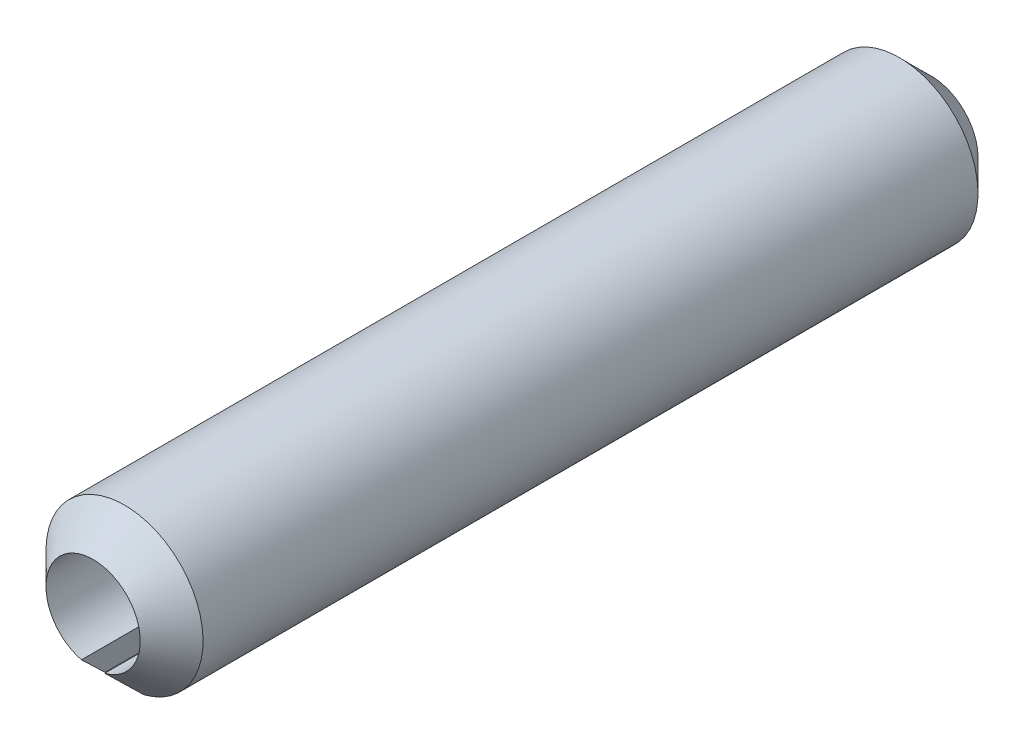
ISO-10303-21;
HEADER;
FILE_DESCRIPTION(('STEP AP214'),'2;1');
FILE_NAME('part.step','',(''),(''),'','','');
FILE_SCHEMA(('AUTOMOTIVE_DESIGN { 1 0 10303 214 1 1 1 1 }'));
ENDSEC;
DATA;
#1=APPLICATION_CONTEXT('core data for automotive mechanical design processes');
#2=APPLICATION_PROTOCOL_DEFINITION('international standard','automotive_design',2000,#1);
#3=PRODUCT_CONTEXT('',#1,'mechanical');
#4=PRODUCT('Part','Part','',(#3));
#5=PRODUCT_RELATED_PRODUCT_CATEGORY('part','',(#4));
#6=PRODUCT_DEFINITION_FORMATION('','',#4);
#7=PRODUCT_DEFINITION_CONTEXT('part definition',#1,'design');
#8=PRODUCT_DEFINITION('design','',#6,#7);
#9=PRODUCT_DEFINITION_SHAPE('','',#8);
#10=(LENGTH_UNIT() NAMED_UNIT(*) SI_UNIT(.MILLI.,.METRE.));
#11=(NAMED_UNIT(*) PLANE_ANGLE_UNIT() SI_UNIT($,.RADIAN.));
#12=(NAMED_UNIT(*) SI_UNIT($,.STERADIAN.) SOLID_ANGLE_UNIT());
#13=UNCERTAINTY_MEASURE_WITH_UNIT(LENGTH_MEASURE(1.E-05),#10,'distance_accuracy_value','');
#14=(GEOMETRIC_REPRESENTATION_CONTEXT(3) GLOBAL_UNCERTAINTY_ASSIGNED_CONTEXT((#13)) GLOBAL_UNIT_ASSIGNED_CONTEXT((#10,
#11,#12)) REPRESENTATION_CONTEXT('',''));
#15=CARTESIAN_POINT('',(0.,0.,0.));
#16=DIRECTION('',(0.,0.,1.));
#17=DIRECTION('',(1.,0.,0.));
#18=AXIS2_PLACEMENT_3D('',#15,#16,#17);
#19=CARTESIAN_POINT('',(0.,0.,-16.));
#20=DIRECTION('',(0.,0.,1.));
#21=DIRECTION('',(1.,0.,0.));
#22=AXIS2_PLACEMENT_3D('',#19,#20,#21);
#23=CYLINDRICAL_SURFACE('',#22,0.900000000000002);
#24=CARTESIAN_POINT('',(0.,0.,0.));
#25=DIRECTION('',(0.,0.,-1.));
#26=DIRECTION('',(1.,0.,0.));
#27=AXIS2_PLACEMENT_3D('',#24,#25,#26);
#28=CIRCLE('',#27,0.900000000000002);
#29=CARTESIAN_POINT('',(-0.222603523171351,-0.872036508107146,0.));
#30=VERTEX_POINT('',#29);
#31=CARTESIAN_POINT('',(0.222603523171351,-0.872036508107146,0.));
#32=VERTEX_POINT('',#31);
#33=EDGE_CURVE('E76',#30,#32,#28,.T.);
#34=ORIENTED_EDGE('',*,*,#33,.F.);
#35=DIRECTION('',(0.,0.,1.));
#36=VECTOR('',#35,1.);
#37=CARTESIAN_POINT('',(-0.222603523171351,-0.872036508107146,-16.));
#38=LINE('',#37,#36);
#39=CARTESIAN_POINT('',(-0.222603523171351,-0.872036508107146,-16.));
#40=VERTEX_POINT('',#39);
#41=EDGE_CURVE('E86',#40,#30,#38,.T.);
#42=ORIENTED_EDGE('',*,*,#41,.F.);
#43=CARTESIAN_POINT('',(0.,0.,-16.));
#44=DIRECTION('',(0.,0.,-1.));
#45=DIRECTION('',(1.,0.,0.));
#46=AXIS2_PLACEMENT_3D('',#43,#44,#45);
#47=CIRCLE('',#46,0.900000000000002);
#48=CARTESIAN_POINT('',(0.222603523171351,-0.872036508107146,-16.));
#49=VERTEX_POINT('',#48);
#50=EDGE_CURVE('E78',#40,#49,#47,.T.);
#51=ORIENTED_EDGE('',*,*,#50,.T.);
#52=DIRECTION('',(0.,0.,1.));
#53=VECTOR('',#52,1.);
#54=CARTESIAN_POINT('',(0.222603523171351,-0.872036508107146,-16.));
#55=LINE('',#54,#53);
#56=EDGE_CURVE('E68',#49,#32,#55,.T.);
#57=ORIENTED_EDGE('',*,*,#56,.T.);
#58=EDGE_LOOP('',(#34,#42,#51,#57));
#59=FACE_BOUND('',#58,.T.);
#60=ADVANCED_FACE('F29',(#59),#23,.F.);
#61=CARTESIAN_POINT('',(-0.222603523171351,-0.872036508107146,-16.));
#62=DIRECTION('',(0.968929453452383,-0.247337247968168,0.));
#63=DIRECTION('',(0.247337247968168,0.968929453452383,0.));
#64=AXIS2_PLACEMENT_3D('',#61,#62,#63);
#65=PLANE('',#64);
#66=ORIENTED_EDGE('',*,*,#41,.T.);
#67=DIRECTION('',(-0.174893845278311,-0.685136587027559,-0.707106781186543));
#68=VECTOR('',#67,1.);
#69=CARTESIAN_POINT('',(0.,0.,0.89999999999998));
#70=LINE('',#69,#68);
#71=CARTESIAN_POINT('',(-0.371005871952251,-1.45339418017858,-0.600000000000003));
#72=VERTEX_POINT('',#71);
#73=EDGE_CURVE('E81',#30,#72,#70,.T.);
#74=ORIENTED_EDGE('',*,*,#73,.T.);
#75=DIRECTION('',(0.,0.,1.));
#76=VECTOR('',#75,1.);
#77=CARTESIAN_POINT('',(-0.371005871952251,-1.45339418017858,-16.));
#78=LINE('',#77,#76);
#79=CARTESIAN_POINT('',(-0.371005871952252,-1.45339418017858,-15.4));
#80=VERTEX_POINT('',#79);
#81=EDGE_CURVE('E89',#80,#72,#78,.T.);
#82=ORIENTED_EDGE('',*,*,#81,.F.);
#83=DIRECTION('',(0.174893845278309,0.685136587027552,-0.707106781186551));
#84=VECTOR('',#83,1.);
#85=CARTESIAN_POINT('',(0.,0.,-16.9));
#86=LINE('',#85,#84);
#87=EDGE_CURVE('E88',#80,#40,#86,.T.);
#88=ORIENTED_EDGE('',*,*,#87,.T.);
#89=EDGE_LOOP('',(#66,#74,#82,#88));
#90=FACE_BOUND('',#89,.T.);
#91=ADVANCED_FACE('F102',(#90),#65,.T.);
#92=CARTESIAN_POINT('',(0.,0.,-16.));
#93=DIRECTION('',(0.,0.,1.));
#94=DIRECTION('',(1.,0.,0.));
#95=AXIS2_PLACEMENT_3D('',#92,#93,#94);
#96=CYLINDRICAL_SURFACE('',#95,1.5);
#97=ORIENTED_EDGE('',*,*,#81,.T.);
#98=CARTESIAN_POINT('',(0.,0.,-0.600000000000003));
#99=DIRECTION('',(0.,0.,1.));
#100=DIRECTION('',(1.,0.,0.));
#101=AXIS2_PLACEMENT_3D('',#98,#99,#100);
#102=CIRCLE('',#101,1.5);
#103=CARTESIAN_POINT('',(0.371005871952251,-1.45339418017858,-0.600000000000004));
#104=VERTEX_POINT('',#103);
#105=EDGE_CURVE('E43',#72,#104,#102,.F.);
#106=ORIENTED_EDGE('',*,*,#105,.T.);
#107=DIRECTION('',(0.,0.,1.));
#108=VECTOR('',#107,1.);
#109=CARTESIAN_POINT('',(0.371005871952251,-1.45339418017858,-16.));
#110=LINE('',#109,#108);
#111=CARTESIAN_POINT('',(0.371005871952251,-1.45339418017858,-15.4));
#112=VERTEX_POINT('',#111);
#113=EDGE_CURVE('E70',#112,#104,#110,.T.);
#114=ORIENTED_EDGE('',*,*,#113,.F.);
#115=CARTESIAN_POINT('',(0.,0.,-15.4));
#116=DIRECTION('',(0.,0.,1.));
#117=DIRECTION('',(1.,0.,0.));
#118=AXIS2_PLACEMENT_3D('',#115,#116,#117);
#119=CIRCLE('',#118,1.5);
#120=EDGE_CURVE('E94',#112,#80,#119,.T.);
#121=ORIENTED_EDGE('',*,*,#120,.T.);
#122=EDGE_LOOP('',(#97,#106,#114,#121));
#123=FACE_BOUND('',#122,.T.);
#124=ADVANCED_FACE('F99',(#123),#96,.T.);
#125=CARTESIAN_POINT('',(0.222603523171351,-0.872036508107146,-16.));
#126=DIRECTION('',(-0.968929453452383,-0.247337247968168,0.));
#127=DIRECTION('',(0.247337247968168,-0.968929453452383,0.));
#128=AXIS2_PLACEMENT_3D('',#125,#126,#127);
#129=PLANE('',#128);
#130=ORIENTED_EDGE('',*,*,#113,.T.);
#131=DIRECTION('',(-0.174893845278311,0.685136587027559,0.707106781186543));
#132=VECTOR('',#131,1.);
#133=CARTESIAN_POINT('',(0.,0.,0.89999999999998));
#134=LINE('',#133,#132);
#135=EDGE_CURVE('E11',#104,#32,#134,.T.);
#136=ORIENTED_EDGE('',*,*,#135,.T.);
#137=ORIENTED_EDGE('',*,*,#56,.F.);
#138=DIRECTION('',(0.174893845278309,-0.685136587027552,0.707106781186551));
#139=VECTOR('',#138,1.);
#140=CARTESIAN_POINT('',(0.,0.,-16.9));
#141=LINE('',#140,#139);
#142=EDGE_CURVE('E36',#49,#112,#141,.T.);
#143=ORIENTED_EDGE('',*,*,#142,.T.);
#144=EDGE_LOOP('',(#130,#136,#137,#143));
#145=FACE_BOUND('',#144,.T.);
#146=ADVANCED_FACE('F67',(#145),#129,.T.);
#147=CARTESIAN_POINT('',(0.,0.,0.));
#148=DIRECTION('',(0.,0.,-1.));
#149=DIRECTION('',(-1.,0.,0.));
#150=AXIS2_PLACEMENT_3D('',#147,#148,#149);
#151=CONICAL_SURFACE('',#150,0.899999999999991,0.785398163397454);
#152=ORIENTED_EDGE('',*,*,#135,.F.);
#153=ORIENTED_EDGE('',*,*,#105,.F.);
#154=ORIENTED_EDGE('',*,*,#73,.F.);
#155=ORIENTED_EDGE('',*,*,#33,.T.);
#156=EDGE_LOOP('',(#152,#153,#154,#155));
#157=FACE_BOUND('',#156,.T.);
#158=ADVANCED_FACE('F80',(#157),#151,.T.);
#159=CARTESIAN_POINT('',(0.,0.,-15.4));
#160=DIRECTION('',(0.,0.,1.));
#161=DIRECTION('',(1.,0.,0.));
#162=AXIS2_PLACEMENT_3D('',#159,#160,#161);
#163=CONICAL_SURFACE('',#162,1.5,0.785398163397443);
#164=ORIENTED_EDGE('',*,*,#142,.F.);
#165=ORIENTED_EDGE('',*,*,#50,.F.);
#166=ORIENTED_EDGE('',*,*,#87,.F.);
#167=ORIENTED_EDGE('',*,*,#120,.F.);
#168=EDGE_LOOP('',(#164,#165,#166,#167));
#169=FACE_BOUND('',#168,.T.);
#170=ADVANCED_FACE('F103',(#169),#163,.T.);
#171=CLOSED_SHELL('',(#60,#91,#124,#146,#158,#170));
#172=MANIFOLD_SOLID_BREP('B2',#171);
#173=ADVANCED_BREP_SHAPE_REPRESENTATION('',(#18,#172),#14);
#174=SHAPE_DEFINITION_REPRESENTATION(#9,#173);
ENDSEC;
END-ISO-10303-21;
